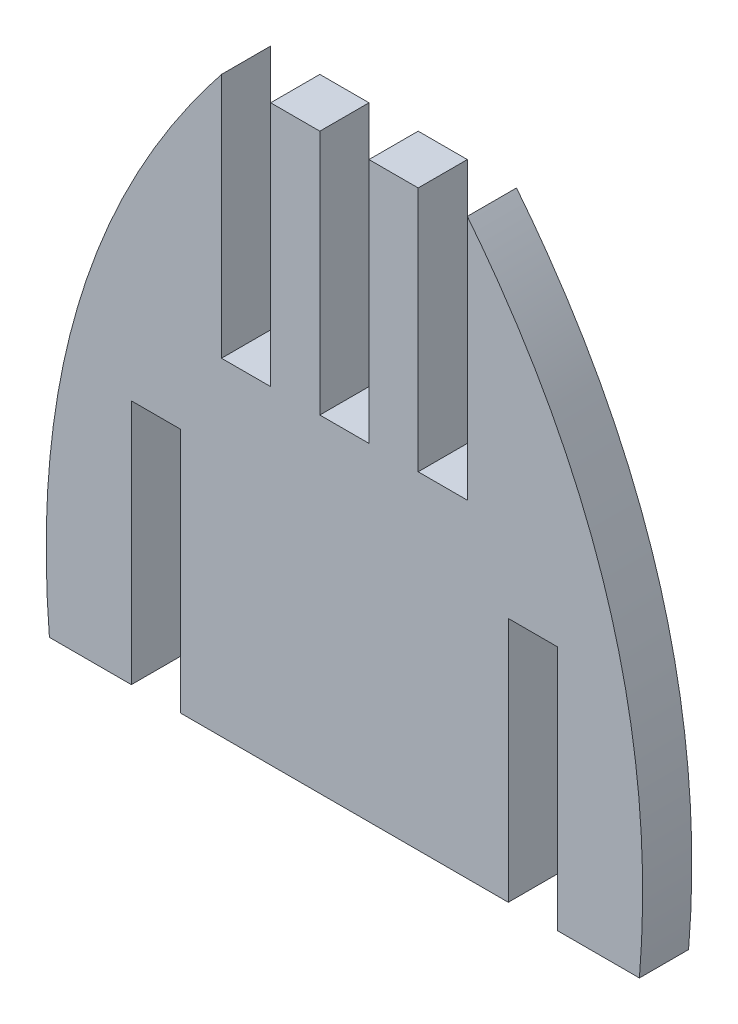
ISO-10303-21;
HEADER;
FILE_DESCRIPTION(('STEP AP214'),'2;1');
FILE_NAME('part.step','',(''),(''),'','','');
FILE_SCHEMA(('AUTOMOTIVE_DESIGN { 1 0 10303 214 1 1 1 1 }'));
ENDSEC;
DATA;
#1=APPLICATION_CONTEXT('core data for automotive mechanical design processes');
#2=APPLICATION_PROTOCOL_DEFINITION('international standard','automotive_design',2000,#1);
#3=PRODUCT_CONTEXT('',#1,'mechanical');
#4=PRODUCT('Part','Part','',(#3));
#5=PRODUCT_RELATED_PRODUCT_CATEGORY('part','',(#4));
#6=PRODUCT_DEFINITION_FORMATION('','',#4);
#7=PRODUCT_DEFINITION_CONTEXT('part definition',#1,'design');
#8=PRODUCT_DEFINITION('design','',#6,#7);
#9=PRODUCT_DEFINITION_SHAPE('','',#8);
#10=(LENGTH_UNIT() NAMED_UNIT(*) SI_UNIT(.MILLI.,.METRE.));
#11=(NAMED_UNIT(*) PLANE_ANGLE_UNIT() SI_UNIT($,.RADIAN.));
#12=(NAMED_UNIT(*) SI_UNIT($,.STERADIAN.) SOLID_ANGLE_UNIT());
#13=UNCERTAINTY_MEASURE_WITH_UNIT(LENGTH_MEASURE(1.E-05),#10,'distance_accuracy_value','');
#14=(GEOMETRIC_REPRESENTATION_CONTEXT(3) GLOBAL_UNCERTAINTY_ASSIGNED_CONTEXT((#13)) GLOBAL_UNIT_ASSIGNED_CONTEXT((#10,
#11,#12)) REPRESENTATION_CONTEXT('',''));
#15=CARTESIAN_POINT('',(0.,0.,0.));
#16=DIRECTION('',(0.,0.,1.));
#17=DIRECTION('',(1.,0.,0.));
#18=AXIS2_PLACEMENT_3D('',#15,#16,#17);
#19=CARTESIAN_POINT('',(15.1019194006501,-0.828022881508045,3.));
#20=DIRECTION('',(0.,1.,0.));
#21=DIRECTION('',(0.,0.,1.));
#22=AXIS2_PLACEMENT_3D('',#19,#20,#21);
#23=PLANE('',#22);
#24=DIRECTION('',(1.,0.,0.));
#25=VECTOR('',#24,1.);
#26=CARTESIAN_POINT('',(15.1019194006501,-0.828022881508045,0.));
#27=LINE('',#26,#25);
#28=CARTESIAN_POINT('',(15.1019194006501,-0.828022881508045,0.));
#29=VERTEX_POINT('',#28);
#30=CARTESIAN_POINT('',(20.1019194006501,-0.828022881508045,0.));
#31=VERTEX_POINT('',#30);
#32=EDGE_CURVE('E221',#29,#31,#27,.T.);
#33=ORIENTED_EDGE('',*,*,#32,.T.);
#34=DIRECTION('',(0.,0.,-1.));
#35=VECTOR('',#34,1.);
#36=CARTESIAN_POINT('',(20.1019194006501,-0.828022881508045,3.));
#37=LINE('',#36,#35);
#38=CARTESIAN_POINT('',(20.1019194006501,-0.828022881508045,3.));
#39=VERTEX_POINT('',#38);
#40=EDGE_CURVE('E11',#39,#31,#37,.T.);
#41=ORIENTED_EDGE('',*,*,#40,.F.);
#42=DIRECTION('',(1.,0.,0.));
#43=VECTOR('',#42,1.);
#44=CARTESIAN_POINT('',(15.1019194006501,-0.828022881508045,3.));
#45=LINE('',#44,#43);
#46=CARTESIAN_POINT('',(15.1019194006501,-0.828022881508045,3.));
#47=VERTEX_POINT('',#46);
#48=EDGE_CURVE('E291',#47,#39,#45,.T.);
#49=ORIENTED_EDGE('',*,*,#48,.F.);
#50=DIRECTION('',(0.,0.,-1.));
#51=VECTOR('',#50,1.);
#52=CARTESIAN_POINT('',(15.1019194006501,-0.828022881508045,3.));
#53=LINE('',#52,#51);
#54=EDGE_CURVE('E55',#47,#29,#53,.T.);
#55=ORIENTED_EDGE('',*,*,#54,.T.);
#56=EDGE_LOOP('',(#33,#41,#49,#55));
#57=FACE_BOUND('',#56,.T.);
#58=ADVANCED_FACE('F39',(#57),#23,.F.);
#59=CARTESIAN_POINT('',(20.1019194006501,-0.828022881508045,3.));
#60=CARTESIAN_POINT('',(21.7532472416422,18.8632007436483,3.));
#61=CARTESIAN_POINT('',(9.60191940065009,34.171977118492,3.));
#62=B_SPLINE_CURVE_WITH_KNOTS('',2,(#59,#60,#61),.UNSPECIFIED.,.F.,.F.,(3,3),(0.,1.),.UNSPECIFIED.);
#63=DIRECTION('',(0.,0.,-1.));
#64=VECTOR('',#63,1.);
#65=SURFACE_OF_LINEAR_EXTRUSION('',#62,#64);
#66=CARTESIAN_POINT('',(20.1019194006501,-0.828022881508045,0.));
#67=CARTESIAN_POINT('',(21.7532472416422,18.8632007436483,0.));
#68=CARTESIAN_POINT('',(9.60191940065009,34.171977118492,0.));
#69=B_SPLINE_CURVE_WITH_KNOTS('',2,(#66,#67,#68),.UNSPECIFIED.,.F.,.F.,(3,3),(0.,1.),.UNSPECIFIED.);
#70=CARTESIAN_POINT('',(9.60191940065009,34.171977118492,0.));
#71=VERTEX_POINT('',#70);
#72=EDGE_CURVE('E223',#31,#71,#69,.T.);
#73=ORIENTED_EDGE('',*,*,#72,.T.);
#74=DIRECTION('',(0.,0.,-1.));
#75=VECTOR('',#74,1.);
#76=CARTESIAN_POINT('',(9.60191940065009,34.171977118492,3.));
#77=LINE('',#76,#75);
#78=CARTESIAN_POINT('',(9.60191940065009,34.171977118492,3.));
#79=VERTEX_POINT('',#78);
#80=EDGE_CURVE('E47',#79,#71,#77,.T.);
#81=ORIENTED_EDGE('',*,*,#80,.F.);
#82=EDGE_CURVE('E136',#39,#79,#62,.T.);
#83=ORIENTED_EDGE('',*,*,#82,.F.);
#84=ORIENTED_EDGE('',*,*,#40,.T.);
#85=EDGE_LOOP('',(#73,#81,#83,#84));
#86=FACE_BOUND('',#85,.T.);
#87=ADVANCED_FACE('F333',(#86),#65,.F.);
#88=CARTESIAN_POINT('',(9.60191940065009,19.171977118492,3.));
#89=DIRECTION('',(-1.,0.,0.));
#90=DIRECTION('',(0.,0.,1.));
#91=AXIS2_PLACEMENT_3D('',#88,#89,#90);
#92=PLANE('',#91);
#93=DIRECTION('',(0.,1.,0.));
#94=VECTOR('',#93,1.);
#95=CARTESIAN_POINT('',(9.60191940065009,19.171977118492,0.));
#96=LINE('',#95,#94);
#97=CARTESIAN_POINT('',(9.60191940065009,19.171977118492,0.));
#98=VERTEX_POINT('',#97);
#99=EDGE_CURVE('E228',#98,#71,#96,.T.);
#100=ORIENTED_EDGE('',*,*,#99,.F.);
#101=DIRECTION('',(0.,0.,-1.));
#102=VECTOR('',#101,1.);
#103=CARTESIAN_POINT('',(9.60191940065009,19.171977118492,3.));
#104=LINE('',#103,#102);
#105=CARTESIAN_POINT('',(9.60191940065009,19.171977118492,3.));
#106=VERTEX_POINT('',#105);
#107=EDGE_CURVE('E326',#106,#98,#104,.T.);
#108=ORIENTED_EDGE('',*,*,#107,.F.);
#109=DIRECTION('',(0.,1.,0.));
#110=VECTOR('',#109,1.);
#111=CARTESIAN_POINT('',(9.60191940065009,19.171977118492,3.));
#112=LINE('',#111,#110);
#113=EDGE_CURVE('E332',#106,#79,#112,.T.);
#114=ORIENTED_EDGE('',*,*,#113,.T.);
#115=ORIENTED_EDGE('',*,*,#80,.T.);
#116=EDGE_LOOP('',(#100,#108,#114,#115));
#117=FACE_BOUND('',#116,.T.);
#118=ADVANCED_FACE('F330',(#117),#92,.T.);
#119=CARTESIAN_POINT('',(6.60191940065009,19.171977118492,3.));
#120=DIRECTION('',(0.,1.,0.));
#121=DIRECTION('',(0.,0.,1.));
#122=AXIS2_PLACEMENT_3D('',#119,#120,#121);
#123=PLANE('',#122);
#124=DIRECTION('',(1.,0.,0.));
#125=VECTOR('',#124,1.);
#126=CARTESIAN_POINT('',(6.60191940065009,19.171977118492,0.));
#127=LINE('',#126,#125);
#128=CARTESIAN_POINT('',(6.60191940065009,19.171977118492,0.));
#129=VERTEX_POINT('',#128);
#130=EDGE_CURVE('E234',#129,#98,#127,.T.);
#131=ORIENTED_EDGE('',*,*,#130,.F.);
#132=DIRECTION('',(0.,0.,-1.));
#133=VECTOR('',#132,1.);
#134=CARTESIAN_POINT('',(6.60191940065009,19.171977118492,3.));
#135=LINE('',#134,#133);
#136=CARTESIAN_POINT('',(6.60191940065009,19.171977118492,3.));
#137=VERTEX_POINT('',#136);
#138=EDGE_CURVE('E324',#137,#129,#135,.T.);
#139=ORIENTED_EDGE('',*,*,#138,.F.);
#140=DIRECTION('',(1.,0.,0.));
#141=VECTOR('',#140,1.);
#142=CARTESIAN_POINT('',(6.60191940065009,19.171977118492,3.));
#143=LINE('',#142,#141);
#144=EDGE_CURVE('E343',#137,#106,#143,.T.);
#145=ORIENTED_EDGE('',*,*,#144,.T.);
#146=ORIENTED_EDGE('',*,*,#107,.T.);
#147=EDGE_LOOP('',(#131,#139,#145,#146));
#148=FACE_BOUND('',#147,.T.);
#149=ADVANCED_FACE('F340',(#148),#123,.T.);
#150=CARTESIAN_POINT('',(6.60191940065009,34.171977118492,3.));
#151=DIRECTION('',(1.,0.,0.));
#152=DIRECTION('',(0.,1.,0.));
#153=AXIS2_PLACEMENT_3D('',#150,#151,#152);
#154=PLANE('',#153);
#155=DIRECTION('',(0.,-1.,0.));
#156=VECTOR('',#155,1.);
#157=CARTESIAN_POINT('',(6.60191940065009,34.171977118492,0.));
#158=LINE('',#157,#156);
#159=CARTESIAN_POINT('',(6.60191940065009,34.171977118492,0.));
#160=VERTEX_POINT('',#159);
#161=EDGE_CURVE('E237',#160,#129,#158,.T.);
#162=ORIENTED_EDGE('',*,*,#161,.F.);
#163=DIRECTION('',(0.,0.,-1.));
#164=VECTOR('',#163,1.);
#165=CARTESIAN_POINT('',(6.60191940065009,34.171977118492,3.));
#166=LINE('',#165,#164);
#167=CARTESIAN_POINT('',(6.60191940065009,34.171977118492,3.));
#168=VERTEX_POINT('',#167);
#169=EDGE_CURVE('E322',#168,#160,#166,.T.);
#170=ORIENTED_EDGE('',*,*,#169,.F.);
#171=DIRECTION('',(0.,-1.,0.));
#172=VECTOR('',#171,1.);
#173=CARTESIAN_POINT('',(6.60191940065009,34.171977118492,3.));
#174=LINE('',#173,#172);
#175=EDGE_CURVE('E347',#168,#137,#174,.T.);
#176=ORIENTED_EDGE('',*,*,#175,.T.);
#177=ORIENTED_EDGE('',*,*,#138,.T.);
#178=EDGE_LOOP('',(#162,#170,#176,#177));
#179=FACE_BOUND('',#178,.T.);
#180=ADVANCED_FACE('F429',(#179),#154,.T.);
#181=CARTESIAN_POINT('',(3.60191940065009,34.171977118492,3.));
#182=DIRECTION('',(0.,1.,0.));
#183=DIRECTION('',(0.,0.,1.));
#184=AXIS2_PLACEMENT_3D('',#181,#182,#183);
#185=PLANE('',#184);
#186=DIRECTION('',(1.,0.,0.));
#187=VECTOR('',#186,1.);
#188=CARTESIAN_POINT('',(3.60191940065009,34.171977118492,0.));
#189=LINE('',#188,#187);
#190=CARTESIAN_POINT('',(3.60191940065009,34.171977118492,0.));
#191=VERTEX_POINT('',#190);
#192=EDGE_CURVE('E240',#191,#160,#189,.T.);
#193=ORIENTED_EDGE('',*,*,#192,.F.);
#194=DIRECTION('',(0.,0.,-1.));
#195=VECTOR('',#194,1.);
#196=CARTESIAN_POINT('',(3.60191940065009,34.171977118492,3.));
#197=LINE('',#196,#195);
#198=CARTESIAN_POINT('',(3.60191940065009,34.171977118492,3.));
#199=VERTEX_POINT('',#198);
#200=EDGE_CURVE('E320',#199,#191,#197,.T.);
#201=ORIENTED_EDGE('',*,*,#200,.F.);
#202=DIRECTION('',(1.,0.,0.));
#203=VECTOR('',#202,1.);
#204=CARTESIAN_POINT('',(3.60191940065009,34.171977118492,3.));
#205=LINE('',#204,#203);
#206=EDGE_CURVE('E356',#199,#168,#205,.T.);
#207=ORIENTED_EDGE('',*,*,#206,.T.);
#208=ORIENTED_EDGE('',*,*,#169,.T.);
#209=EDGE_LOOP('',(#193,#201,#207,#208));
#210=FACE_BOUND('',#209,.T.);
#211=ADVANCED_FACE('F425',(#210),#185,.T.);
#212=CARTESIAN_POINT('',(3.60191940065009,19.171977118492,3.));
#213=DIRECTION('',(-1.,0.,0.));
#214=DIRECTION('',(0.,0.,1.));
#215=AXIS2_PLACEMENT_3D('',#212,#213,#214);
#216=PLANE('',#215);
#217=DIRECTION('',(0.,1.,0.));
#218=VECTOR('',#217,1.);
#219=CARTESIAN_POINT('',(3.60191940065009,19.171977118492,0.));
#220=LINE('',#219,#218);
#221=CARTESIAN_POINT('',(3.60191940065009,19.171977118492,0.));
#222=VERTEX_POINT('',#221);
#223=EDGE_CURVE('E243',#222,#191,#220,.T.);
#224=ORIENTED_EDGE('',*,*,#223,.F.);
#225=DIRECTION('',(0.,0.,-1.));
#226=VECTOR('',#225,1.);
#227=CARTESIAN_POINT('',(3.60191940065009,19.171977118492,3.));
#228=LINE('',#227,#226);
#229=CARTESIAN_POINT('',(3.60191940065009,19.171977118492,3.));
#230=VERTEX_POINT('',#229);
#231=EDGE_CURVE('E318',#230,#222,#228,.T.);
#232=ORIENTED_EDGE('',*,*,#231,.F.);
#233=DIRECTION('',(0.,1.,0.));
#234=VECTOR('',#233,1.);
#235=CARTESIAN_POINT('',(3.60191940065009,19.171977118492,3.));
#236=LINE('',#235,#234);
#237=EDGE_CURVE('E359',#230,#199,#236,.T.);
#238=ORIENTED_EDGE('',*,*,#237,.T.);
#239=ORIENTED_EDGE('',*,*,#200,.T.);
#240=EDGE_LOOP('',(#224,#232,#238,#239));
#241=FACE_BOUND('',#240,.T.);
#242=ADVANCED_FACE('F421',(#241),#216,.T.);
#243=CARTESIAN_POINT('',(0.601919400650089,19.171977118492,3.));
#244=DIRECTION('',(0.,1.,0.));
#245=DIRECTION('',(0.,0.,1.));
#246=AXIS2_PLACEMENT_3D('',#243,#244,#245);
#247=PLANE('',#246);
#248=DIRECTION('',(1.,0.,0.));
#249=VECTOR('',#248,1.);
#250=CARTESIAN_POINT('',(0.601919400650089,19.171977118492,0.));
#251=LINE('',#250,#249);
#252=CARTESIAN_POINT('',(0.601919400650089,19.171977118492,0.));
#253=VERTEX_POINT('',#252);
#254=EDGE_CURVE('E246',#253,#222,#251,.T.);
#255=ORIENTED_EDGE('',*,*,#254,.F.);
#256=DIRECTION('',(0.,0.,-1.));
#257=VECTOR('',#256,1.);
#258=CARTESIAN_POINT('',(0.601919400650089,19.171977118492,3.));
#259=LINE('',#258,#257);
#260=CARTESIAN_POINT('',(0.601919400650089,19.171977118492,3.));
#261=VERTEX_POINT('',#260);
#262=EDGE_CURVE('E316',#261,#253,#259,.T.);
#263=ORIENTED_EDGE('',*,*,#262,.F.);
#264=DIRECTION('',(1.,0.,0.));
#265=VECTOR('',#264,1.);
#266=CARTESIAN_POINT('',(0.601919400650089,19.171977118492,3.));
#267=LINE('',#266,#265);
#268=EDGE_CURVE('E362',#261,#230,#267,.T.);
#269=ORIENTED_EDGE('',*,*,#268,.T.);
#270=ORIENTED_EDGE('',*,*,#231,.T.);
#271=EDGE_LOOP('',(#255,#263,#269,#270));
#272=FACE_BOUND('',#271,.T.);
#273=ADVANCED_FACE('F417',(#272),#247,.T.);
#274=CARTESIAN_POINT('',(0.601919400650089,19.171977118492,3.));
#275=DIRECTION('',(-1.,0.,0.));
#276=DIRECTION('',(0.,0.,1.));
#277=AXIS2_PLACEMENT_3D('',#274,#275,#276);
#278=PLANE('',#277);
#279=DIRECTION('',(0.,1.,0.));
#280=VECTOR('',#279,1.);
#281=CARTESIAN_POINT('',(0.601919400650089,19.171977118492,0.));
#282=LINE('',#281,#280);
#283=CARTESIAN_POINT('',(0.601919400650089,34.171977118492,0.));
#284=VERTEX_POINT('',#283);
#285=EDGE_CURVE('E249',#253,#284,#282,.T.);
#286=ORIENTED_EDGE('',*,*,#285,.T.);
#287=DIRECTION('',(0.,0.,-1.));
#288=VECTOR('',#287,1.);
#289=CARTESIAN_POINT('',(0.601919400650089,34.171977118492,3.));
#290=LINE('',#289,#288);
#291=CARTESIAN_POINT('',(0.601919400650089,34.171977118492,3.));
#292=VERTEX_POINT('',#291);
#293=EDGE_CURVE('E314',#292,#284,#290,.T.);
#294=ORIENTED_EDGE('',*,*,#293,.F.);
#295=DIRECTION('',(0.,1.,0.));
#296=VECTOR('',#295,1.);
#297=CARTESIAN_POINT('',(0.601919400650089,19.171977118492,3.));
#298=LINE('',#297,#296);
#299=EDGE_CURVE('E365',#261,#292,#298,.T.);
#300=ORIENTED_EDGE('',*,*,#299,.F.);
#301=ORIENTED_EDGE('',*,*,#262,.T.);
#302=EDGE_LOOP('',(#286,#294,#300,#301));
#303=FACE_BOUND('',#302,.T.);
#304=ADVANCED_FACE('F413',(#303),#278,.F.);
#305=CARTESIAN_POINT('',(-2.39808059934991,34.171977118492,3.));
#306=DIRECTION('',(0.,1.,0.));
#307=DIRECTION('',(0.,0.,1.));
#308=AXIS2_PLACEMENT_3D('',#305,#306,#307);
#309=PLANE('',#308);
#310=DIRECTION('',(1.,0.,0.));
#311=VECTOR('',#310,1.);
#312=CARTESIAN_POINT('',(-2.39808059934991,34.171977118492,0.));
#313=LINE('',#312,#311);
#314=CARTESIAN_POINT('',(-2.39808059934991,34.171977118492,0.));
#315=VERTEX_POINT('',#314);
#316=EDGE_CURVE('E252',#315,#284,#313,.T.);
#317=ORIENTED_EDGE('',*,*,#316,.F.);
#318=DIRECTION('',(0.,0.,-1.));
#319=VECTOR('',#318,1.);
#320=CARTESIAN_POINT('',(-2.39808059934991,34.171977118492,3.));
#321=LINE('',#320,#319);
#322=CARTESIAN_POINT('',(-2.39808059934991,34.171977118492,3.));
#323=VERTEX_POINT('',#322);
#324=EDGE_CURVE('E312',#323,#315,#321,.T.);
#325=ORIENTED_EDGE('',*,*,#324,.F.);
#326=DIRECTION('',(1.,0.,0.));
#327=VECTOR('',#326,1.);
#328=CARTESIAN_POINT('',(-2.39808059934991,34.171977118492,3.));
#329=LINE('',#328,#327);
#330=EDGE_CURVE('E367',#323,#292,#329,.T.);
#331=ORIENTED_EDGE('',*,*,#330,.T.);
#332=ORIENTED_EDGE('',*,*,#293,.T.);
#333=EDGE_LOOP('',(#317,#325,#331,#332));
#334=FACE_BOUND('',#333,.T.);
#335=ADVANCED_FACE('F409',(#334),#309,.T.);
#336=CARTESIAN_POINT('',(-2.39808059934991,19.171977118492,3.));
#337=DIRECTION('',(-1.,0.,0.));
#338=DIRECTION('',(0.,0.,1.));
#339=AXIS2_PLACEMENT_3D('',#336,#337,#338);
#340=PLANE('',#339);
#341=DIRECTION('',(0.,1.,0.));
#342=VECTOR('',#341,1.);
#343=CARTESIAN_POINT('',(-2.39808059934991,19.171977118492,0.));
#344=LINE('',#343,#342);
#345=CARTESIAN_POINT('',(-2.39808059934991,19.171977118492,0.));
#346=VERTEX_POINT('',#345);
#347=EDGE_CURVE('E255',#346,#315,#344,.T.);
#348=ORIENTED_EDGE('',*,*,#347,.F.);
#349=DIRECTION('',(0.,0.,-1.));
#350=VECTOR('',#349,1.);
#351=CARTESIAN_POINT('',(-2.39808059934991,19.171977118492,3.));
#352=LINE('',#351,#350);
#353=CARTESIAN_POINT('',(-2.39808059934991,19.171977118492,3.));
#354=VERTEX_POINT('',#353);
#355=EDGE_CURVE('E310',#354,#346,#352,.T.);
#356=ORIENTED_EDGE('',*,*,#355,.F.);
#357=DIRECTION('',(0.,1.,0.));
#358=VECTOR('',#357,1.);
#359=CARTESIAN_POINT('',(-2.39808059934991,19.171977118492,3.));
#360=LINE('',#359,#358);
#361=EDGE_CURVE('E370',#354,#323,#360,.T.);
#362=ORIENTED_EDGE('',*,*,#361,.T.);
#363=ORIENTED_EDGE('',*,*,#324,.T.);
#364=EDGE_LOOP('',(#348,#356,#362,#363));
#365=FACE_BOUND('',#364,.T.);
#366=ADVANCED_FACE('F405',(#365),#340,.T.);
#367=CARTESIAN_POINT('',(-5.39808059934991,19.171977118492,3.));
#368=DIRECTION('',(0.,1.,0.));
#369=DIRECTION('',(0.,0.,1.));
#370=AXIS2_PLACEMENT_3D('',#367,#368,#369);
#371=PLANE('',#370);
#372=DIRECTION('',(1.,0.,0.));
#373=VECTOR('',#372,1.);
#374=CARTESIAN_POINT('',(-5.39808059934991,19.171977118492,0.));
#375=LINE('',#374,#373);
#376=CARTESIAN_POINT('',(-5.39808059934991,19.171977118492,0.));
#377=VERTEX_POINT('',#376);
#378=EDGE_CURVE('E258',#377,#346,#375,.T.);
#379=ORIENTED_EDGE('',*,*,#378,.F.);
#380=DIRECTION('',(0.,0.,-1.));
#381=VECTOR('',#380,1.);
#382=CARTESIAN_POINT('',(-5.39808059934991,19.171977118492,3.));
#383=LINE('',#382,#381);
#384=CARTESIAN_POINT('',(-5.39808059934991,19.171977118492,3.));
#385=VERTEX_POINT('',#384);
#386=EDGE_CURVE('E308',#385,#377,#383,.T.);
#387=ORIENTED_EDGE('',*,*,#386,.F.);
#388=DIRECTION('',(1.,0.,0.));
#389=VECTOR('',#388,1.);
#390=CARTESIAN_POINT('',(-5.39808059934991,19.171977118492,3.));
#391=LINE('',#390,#389);
#392=EDGE_CURVE('E373',#385,#354,#391,.T.);
#393=ORIENTED_EDGE('',*,*,#392,.T.);
#394=ORIENTED_EDGE('',*,*,#355,.T.);
#395=EDGE_LOOP('',(#379,#387,#393,#394));
#396=FACE_BOUND('',#395,.T.);
#397=ADVANCED_FACE('F401',(#396),#371,.T.);
#398=CARTESIAN_POINT('',(-5.39808059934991,34.171977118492,3.));
#399=DIRECTION('',(1.,0.,0.));
#400=DIRECTION('',(0.,1.,0.));
#401=AXIS2_PLACEMENT_3D('',#398,#399,#400);
#402=PLANE('',#401);
#403=DIRECTION('',(0.,-1.,0.));
#404=VECTOR('',#403,1.);
#405=CARTESIAN_POINT('',(-5.39808059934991,34.171977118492,0.));
#406=LINE('',#405,#404);
#407=CARTESIAN_POINT('',(-5.39808059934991,34.171977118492,0.));
#408=VERTEX_POINT('',#407);
#409=EDGE_CURVE('E261',#408,#377,#406,.T.);
#410=ORIENTED_EDGE('',*,*,#409,.F.);
#411=DIRECTION('',(0.,0.,-1.));
#412=VECTOR('',#411,1.);
#413=CARTESIAN_POINT('',(-5.39808059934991,34.171977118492,3.));
#414=LINE('',#413,#412);
#415=CARTESIAN_POINT('',(-5.39808059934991,34.171977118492,3.));
#416=VERTEX_POINT('',#415);
#417=EDGE_CURVE('E306',#416,#408,#414,.T.);
#418=ORIENTED_EDGE('',*,*,#417,.F.);
#419=DIRECTION('',(0.,-1.,0.));
#420=VECTOR('',#419,1.);
#421=CARTESIAN_POINT('',(-5.39808059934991,34.171977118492,3.));
#422=LINE('',#421,#420);
#423=EDGE_CURVE('E376',#416,#385,#422,.T.);
#424=ORIENTED_EDGE('',*,*,#423,.T.);
#425=ORIENTED_EDGE('',*,*,#386,.T.);
#426=EDGE_LOOP('',(#410,#418,#424,#425));
#427=FACE_BOUND('',#426,.T.);
#428=ADVANCED_FACE('F396',(#427),#402,.T.);
#429=CARTESIAN_POINT('',(-15.8980805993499,-0.828022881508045,3.));
#430=CARTESIAN_POINT('',(-17.549408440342,18.8632007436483,3.));
#431=CARTESIAN_POINT('',(-5.39808059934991,34.171977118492,3.));
#432=B_SPLINE_CURVE_WITH_KNOTS('',2,(#429,#430,#431),.UNSPECIFIED.,.F.,.F.,(3,3),(0.,1.),.UNSPECIFIED.);
#433=DIRECTION('',(0.,0.,-1.));
#434=VECTOR('',#433,1.);
#435=SURFACE_OF_LINEAR_EXTRUSION('',#432,#434);
#436=CARTESIAN_POINT('',(-15.8980805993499,-0.828022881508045,0.));
#437=CARTESIAN_POINT('',(-17.549408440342,18.8632007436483,0.));
#438=CARTESIAN_POINT('',(-5.39808059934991,34.171977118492,0.));
#439=B_SPLINE_CURVE_WITH_KNOTS('',2,(#436,#437,#438),.UNSPECIFIED.,.F.,.F.,(3,3),(0.,1.),.UNSPECIFIED.);
#440=CARTESIAN_POINT('',(-15.8980805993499,-0.828022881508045,0.));
#441=VERTEX_POINT('',#440);
#442=EDGE_CURVE('E264',#441,#408,#439,.T.);
#443=ORIENTED_EDGE('',*,*,#442,.F.);
#444=DIRECTION('',(0.,0.,-1.));
#445=VECTOR('',#444,1.);
#446=CARTESIAN_POINT('',(-15.8980805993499,-0.828022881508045,3.));
#447=LINE('',#446,#445);
#448=CARTESIAN_POINT('',(-15.8980805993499,-0.828022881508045,3.));
#449=VERTEX_POINT('',#448);
#450=EDGE_CURVE('E304',#449,#441,#447,.T.);
#451=ORIENTED_EDGE('',*,*,#450,.F.);
#452=EDGE_CURVE('E379',#449,#416,#432,.T.);
#453=ORIENTED_EDGE('',*,*,#452,.T.);
#454=ORIENTED_EDGE('',*,*,#417,.T.);
#455=EDGE_LOOP('',(#443,#451,#453,#454));
#456=FACE_BOUND('',#455,.T.);
#457=ADVANCED_FACE('F391',(#456),#435,.T.);
#458=CARTESIAN_POINT('',(-15.8980805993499,-0.828022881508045,3.));
#459=DIRECTION('',(0.,1.,0.));
#460=DIRECTION('',(0.,0.,1.));
#461=AXIS2_PLACEMENT_3D('',#458,#459,#460);
#462=PLANE('',#461);
#463=DIRECTION('',(1.,0.,0.));
#464=VECTOR('',#463,1.);
#465=CARTESIAN_POINT('',(-15.8980805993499,-0.828022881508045,0.));
#466=LINE('',#465,#464);
#467=CARTESIAN_POINT('',(-10.8980805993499,-0.828022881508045,0.));
#468=VERTEX_POINT('',#467);
#469=EDGE_CURVE('E269',#441,#468,#466,.T.);
#470=ORIENTED_EDGE('',*,*,#469,.T.);
#471=DIRECTION('',(0.,0.,-1.));
#472=VECTOR('',#471,1.);
#473=CARTESIAN_POINT('',(-10.8980805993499,-0.828022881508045,3.));
#474=LINE('',#473,#472);
#475=CARTESIAN_POINT('',(-10.8980805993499,-0.828022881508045,3.));
#476=VERTEX_POINT('',#475);
#477=EDGE_CURVE('E301',#476,#468,#474,.T.);
#478=ORIENTED_EDGE('',*,*,#477,.F.);
#479=DIRECTION('',(1.,0.,0.));
#480=VECTOR('',#479,1.);
#481=CARTESIAN_POINT('',(-15.8980805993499,-0.828022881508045,3.));
#482=LINE('',#481,#480);
#483=EDGE_CURVE('E385',#449,#476,#482,.T.);
#484=ORIENTED_EDGE('',*,*,#483,.F.);
#485=ORIENTED_EDGE('',*,*,#450,.T.);
#486=EDGE_LOOP('',(#470,#478,#484,#485));
#487=FACE_BOUND('',#486,.T.);
#488=ADVANCED_FACE('F395',(#487),#462,.F.);
#489=CARTESIAN_POINT('',(-10.8980805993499,-0.828022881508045,3.));
#490=DIRECTION('',(-1.,0.,0.));
#491=DIRECTION('',(0.,-1.,0.));
#492=AXIS2_PLACEMENT_3D('',#489,#490,#491);
#493=PLANE('',#492);
#494=DIRECTION('',(0.,1.,0.));
#495=VECTOR('',#494,1.);
#496=CARTESIAN_POINT('',(-10.8980805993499,-0.828022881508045,0.));
#497=LINE('',#496,#495);
#498=CARTESIAN_POINT('',(-10.8980805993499,14.171977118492,0.));
#499=VERTEX_POINT('',#498);
#500=EDGE_CURVE('E274',#468,#499,#497,.T.);
#501=ORIENTED_EDGE('',*,*,#500,.T.);
#502=DIRECTION('',(0.,0.,-1.));
#503=VECTOR('',#502,1.);
#504=CARTESIAN_POINT('',(-10.8980805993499,14.171977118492,3.));
#505=LINE('',#504,#503);
#506=CARTESIAN_POINT('',(-10.8980805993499,14.171977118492,3.));
#507=VERTEX_POINT('',#506);
#508=EDGE_CURVE('E299',#507,#499,#505,.T.);
#509=ORIENTED_EDGE('',*,*,#508,.F.);
#510=DIRECTION('',(0.,1.,0.));
#511=VECTOR('',#510,1.);
#512=CARTESIAN_POINT('',(-10.8980805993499,-0.828022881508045,3.));
#513=LINE('',#512,#511);
#514=EDGE_CURVE('E487',#476,#507,#513,.T.);
#515=ORIENTED_EDGE('',*,*,#514,.F.);
#516=ORIENTED_EDGE('',*,*,#477,.T.);
#517=EDGE_LOOP('',(#501,#509,#515,#516));
#518=FACE_BOUND('',#517,.T.);
#519=ADVANCED_FACE('F466',(#518),#493,.F.);
#520=CARTESIAN_POINT('',(-7.89808059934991,14.171977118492,3.));
#521=DIRECTION('',(0.,-1.,0.));
#522=DIRECTION('',(0.,0.,-1.));
#523=AXIS2_PLACEMENT_3D('',#520,#521,#522);
#524=PLANE('',#523);
#525=DIRECTION('',(-1.,0.,0.));
#526=VECTOR('',#525,1.);
#527=CARTESIAN_POINT('',(-7.89808059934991,14.171977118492,0.));
#528=LINE('',#527,#526);
#529=CARTESIAN_POINT('',(-7.89808059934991,14.171977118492,0.));
#530=VERTEX_POINT('',#529);
#531=EDGE_CURVE('E277',#530,#499,#528,.T.);
#532=ORIENTED_EDGE('',*,*,#531,.F.);
#533=DIRECTION('',(0.,0.,-1.));
#534=VECTOR('',#533,1.);
#535=CARTESIAN_POINT('',(-7.89808059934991,14.171977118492,3.));
#536=LINE('',#535,#534);
#537=CARTESIAN_POINT('',(-7.89808059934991,14.171977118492,3.));
#538=VERTEX_POINT('',#537);
#539=EDGE_CURVE('E297',#538,#530,#536,.T.);
#540=ORIENTED_EDGE('',*,*,#539,.F.);
#541=DIRECTION('',(-1.,0.,0.));
#542=VECTOR('',#541,1.);
#543=CARTESIAN_POINT('',(-7.89808059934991,14.171977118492,3.));
#544=LINE('',#543,#542);
#545=EDGE_CURVE('E484',#538,#507,#544,.T.);
#546=ORIENTED_EDGE('',*,*,#545,.T.);
#547=ORIENTED_EDGE('',*,*,#508,.T.);
#548=EDGE_LOOP('',(#532,#540,#546,#547));
#549=FACE_BOUND('',#548,.T.);
#550=ADVANCED_FACE('F463',(#549),#524,.T.);
#551=CARTESIAN_POINT('',(-7.89808059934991,-0.828022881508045,3.));
#552=DIRECTION('',(-1.,0.,0.));
#553=DIRECTION('',(0.,-1.,0.));
#554=AXIS2_PLACEMENT_3D('',#551,#552,#553);
#555=PLANE('',#554);
#556=DIRECTION('',(0.,1.,0.));
#557=VECTOR('',#556,1.);
#558=CARTESIAN_POINT('',(-7.89808059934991,-0.828022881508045,0.));
#559=LINE('',#558,#557);
#560=CARTESIAN_POINT('',(-7.89808059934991,-0.828022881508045,0.));
#561=VERTEX_POINT('',#560);
#562=EDGE_CURVE('E280',#561,#530,#559,.T.);
#563=ORIENTED_EDGE('',*,*,#562,.F.);
#564=DIRECTION('',(0.,0.,-1.));
#565=VECTOR('',#564,1.);
#566=CARTESIAN_POINT('',(-7.89808059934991,-0.828022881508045,3.));
#567=LINE('',#566,#565);
#568=CARTESIAN_POINT('',(-7.89808059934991,-0.828022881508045,3.));
#569=VERTEX_POINT('',#568);
#570=EDGE_CURVE('E295',#569,#561,#567,.T.);
#571=ORIENTED_EDGE('',*,*,#570,.F.);
#572=DIRECTION('',(0.,1.,0.));
#573=VECTOR('',#572,1.);
#574=CARTESIAN_POINT('',(-7.89808059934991,-0.828022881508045,3.));
#575=LINE('',#574,#573);
#576=EDGE_CURVE('E486',#569,#538,#575,.T.);
#577=ORIENTED_EDGE('',*,*,#576,.T.);
#578=ORIENTED_EDGE('',*,*,#539,.T.);
#579=EDGE_LOOP('',(#563,#571,#577,#578));
#580=FACE_BOUND('',#579,.T.);
#581=ADVANCED_FACE('F459',(#580),#555,.T.);
#582=CARTESIAN_POINT('',(-7.89808059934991,-0.828022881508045,3.));
#583=DIRECTION('',(0.,1.,0.));
#584=DIRECTION('',(0.,0.,1.));
#585=AXIS2_PLACEMENT_3D('',#582,#583,#584);
#586=PLANE('',#585);
#587=DIRECTION('',(1.,0.,0.));
#588=VECTOR('',#587,1.);
#589=CARTESIAN_POINT('',(-7.89808059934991,-0.828022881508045,0.));
#590=LINE('',#589,#588);
#591=CARTESIAN_POINT('',(12.1019194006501,-0.828022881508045,0.));
#592=VERTEX_POINT('',#591);
#593=EDGE_CURVE('E283',#561,#592,#590,.T.);
#594=ORIENTED_EDGE('',*,*,#593,.T.);
#595=DIRECTION('',(0.,0.,-1.));
#596=VECTOR('',#595,1.);
#597=CARTESIAN_POINT('',(12.1019194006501,-0.828022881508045,3.));
#598=LINE('',#597,#596);
#599=CARTESIAN_POINT('',(12.1019194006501,-0.828022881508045,3.));
#600=VERTEX_POINT('',#599);
#601=EDGE_CURVE('E213',#600,#592,#598,.T.);
#602=ORIENTED_EDGE('',*,*,#601,.F.);
#603=DIRECTION('',(1.,0.,0.));
#604=VECTOR('',#603,1.);
#605=CARTESIAN_POINT('',(-7.89808059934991,-0.828022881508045,3.));
#606=LINE('',#605,#604);
#607=EDGE_CURVE('E201',#569,#600,#606,.T.);
#608=ORIENTED_EDGE('',*,*,#607,.F.);
#609=ORIENTED_EDGE('',*,*,#570,.T.);
#610=EDGE_LOOP('',(#594,#602,#608,#609));
#611=FACE_BOUND('',#610,.T.);
#612=ADVANCED_FACE('F456',(#611),#586,.F.);
#613=CARTESIAN_POINT('',(12.1019194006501,-0.828022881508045,3.));
#614=DIRECTION('',(-1.,0.,0.));
#615=DIRECTION('',(0.,-1.,0.));
#616=AXIS2_PLACEMENT_3D('',#613,#614,#615);
#617=PLANE('',#616);
#618=DIRECTION('',(0.,1.,0.));
#619=VECTOR('',#618,1.);
#620=CARTESIAN_POINT('',(12.1019194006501,-0.828022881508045,0.));
#621=LINE('',#620,#619);
#622=CARTESIAN_POINT('',(12.1019194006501,14.171977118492,0.));
#623=VERTEX_POINT('',#622);
#624=EDGE_CURVE('E210',#592,#623,#621,.T.);
#625=ORIENTED_EDGE('',*,*,#624,.T.);
#626=DIRECTION('',(0.,0.,-1.));
#627=VECTOR('',#626,1.);
#628=CARTESIAN_POINT('',(12.1019194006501,14.171977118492,3.));
#629=LINE('',#628,#627);
#630=CARTESIAN_POINT('',(12.1019194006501,14.171977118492,3.));
#631=VERTEX_POINT('',#630);
#632=EDGE_CURVE('E207',#631,#623,#629,.T.);
#633=ORIENTED_EDGE('',*,*,#632,.F.);
#634=DIRECTION('',(0.,1.,0.));
#635=VECTOR('',#634,1.);
#636=CARTESIAN_POINT('',(12.1019194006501,-0.828022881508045,3.));
#637=LINE('',#636,#635);
#638=EDGE_CURVE('E193',#600,#631,#637,.T.);
#639=ORIENTED_EDGE('',*,*,#638,.F.);
#640=ORIENTED_EDGE('',*,*,#601,.T.);
#641=EDGE_LOOP('',(#625,#633,#639,#640));
#642=FACE_BOUND('',#641,.T.);
#643=ADVANCED_FACE('F208',(#642),#617,.F.);
#644=CARTESIAN_POINT('',(12.1019194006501,14.171977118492,3.));
#645=DIRECTION('',(0.,1.,0.));
#646=DIRECTION('',(0.,0.,1.));
#647=AXIS2_PLACEMENT_3D('',#644,#645,#646);
#648=PLANE('',#647);
#649=DIRECTION('',(1.,0.,0.));
#650=VECTOR('',#649,1.);
#651=CARTESIAN_POINT('',(12.1019194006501,14.171977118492,0.));
#652=LINE('',#651,#650);
#653=CARTESIAN_POINT('',(15.1019194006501,14.171977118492,0.));
#654=VERTEX_POINT('',#653);
#655=EDGE_CURVE('E286',#623,#654,#652,.T.);
#656=ORIENTED_EDGE('',*,*,#655,.T.);
#657=DIRECTION('',(0.,0.,-1.));
#658=VECTOR('',#657,1.);
#659=CARTESIAN_POINT('',(15.1019194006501,14.171977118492,3.));
#660=LINE('',#659,#658);
#661=CARTESIAN_POINT('',(15.1019194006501,14.171977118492,3.));
#662=VERTEX_POINT('',#661);
#663=EDGE_CURVE('E124',#662,#654,#660,.T.);
#664=ORIENTED_EDGE('',*,*,#663,.F.);
#665=DIRECTION('',(1.,0.,0.));
#666=VECTOR('',#665,1.);
#667=CARTESIAN_POINT('',(12.1019194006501,14.171977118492,3.));
#668=LINE('',#667,#666);
#669=EDGE_CURVE('E198',#631,#662,#668,.T.);
#670=ORIENTED_EDGE('',*,*,#669,.F.);
#671=ORIENTED_EDGE('',*,*,#632,.T.);
#672=EDGE_LOOP('',(#656,#664,#670,#671));
#673=FACE_BOUND('',#672,.T.);
#674=ADVANCED_FACE('F215',(#673),#648,.F.);
#675=CARTESIAN_POINT('',(15.1019194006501,-0.828022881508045,3.));
#676=DIRECTION('',(-1.,0.,0.));
#677=DIRECTION('',(0.,-1.,0.));
#678=AXIS2_PLACEMENT_3D('',#675,#676,#677);
#679=PLANE('',#678);
#680=DIRECTION('',(0.,1.,0.));
#681=VECTOR('',#680,1.);
#682=CARTESIAN_POINT('',(15.1019194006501,-0.828022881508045,0.));
#683=LINE('',#682,#681);
#684=EDGE_CURVE('E288',#29,#654,#683,.T.);
#685=ORIENTED_EDGE('',*,*,#684,.F.);
#686=ORIENTED_EDGE('',*,*,#54,.F.);
#687=DIRECTION('',(0.,1.,0.));
#688=VECTOR('',#687,1.);
#689=CARTESIAN_POINT('',(15.1019194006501,-0.828022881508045,3.));
#690=LINE('',#689,#688);
#691=EDGE_CURVE('E216',#47,#662,#690,.T.);
#692=ORIENTED_EDGE('',*,*,#691,.T.);
#693=ORIENTED_EDGE('',*,*,#663,.T.);
#694=EDGE_LOOP('',(#685,#686,#692,#693));
#695=FACE_BOUND('',#694,.T.);
#696=ADVANCED_FACE('F443',(#695),#679,.T.);
#697=CARTESIAN_POINT('',(18.3025833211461,17.7675889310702,3.));
#698=DIRECTION('',(0.,0.,-1.));
#699=DIRECTION('',(-1.,0.,0.));
#700=AXIS2_PLACEMENT_3D('',#697,#698,#699);
#701=PLANE('',#700);
#702=ORIENTED_EDGE('',*,*,#48,.T.);
#703=ORIENTED_EDGE('',*,*,#82,.T.);
#704=ORIENTED_EDGE('',*,*,#113,.F.);
#705=ORIENTED_EDGE('',*,*,#144,.F.);
#706=ORIENTED_EDGE('',*,*,#175,.F.);
#707=ORIENTED_EDGE('',*,*,#206,.F.);
#708=ORIENTED_EDGE('',*,*,#237,.F.);
#709=ORIENTED_EDGE('',*,*,#268,.F.);
#710=ORIENTED_EDGE('',*,*,#299,.T.);
#711=ORIENTED_EDGE('',*,*,#330,.F.);
#712=ORIENTED_EDGE('',*,*,#361,.F.);
#713=ORIENTED_EDGE('',*,*,#392,.F.);
#714=ORIENTED_EDGE('',*,*,#423,.F.);
#715=ORIENTED_EDGE('',*,*,#452,.F.);
#716=ORIENTED_EDGE('',*,*,#483,.T.);
#717=ORIENTED_EDGE('',*,*,#514,.T.);
#718=ORIENTED_EDGE('',*,*,#545,.F.);
#719=ORIENTED_EDGE('',*,*,#576,.F.);
#720=ORIENTED_EDGE('',*,*,#607,.T.);
#721=ORIENTED_EDGE('',*,*,#638,.T.);
#722=ORIENTED_EDGE('',*,*,#669,.T.);
#723=ORIENTED_EDGE('',*,*,#691,.F.);
#724=EDGE_LOOP('',(#702,#703,#704,#705,#706,#707,#708,#709,#710,#711,#712,#713,#714,#715,#716,
#717,#718,#719,#720,#721,#722,#723));
#725=FACE_BOUND('',#724,.T.);
#726=ADVANCED_FACE('F195',(#725),#701,.F.);
#727=CARTESIAN_POINT('',(18.3025833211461,17.7675889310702,0.));
#728=DIRECTION('',(0.,0.,-1.));
#729=DIRECTION('',(-1.,0.,0.));
#730=AXIS2_PLACEMENT_3D('',#727,#728,#729);
#731=PLANE('',#730);
#732=ORIENTED_EDGE('',*,*,#32,.F.);
#733=ORIENTED_EDGE('',*,*,#684,.T.);
#734=ORIENTED_EDGE('',*,*,#655,.F.);
#735=ORIENTED_EDGE('',*,*,#624,.F.);
#736=ORIENTED_EDGE('',*,*,#593,.F.);
#737=ORIENTED_EDGE('',*,*,#562,.T.);
#738=ORIENTED_EDGE('',*,*,#531,.T.);
#739=ORIENTED_EDGE('',*,*,#500,.F.);
#740=ORIENTED_EDGE('',*,*,#469,.F.);
#741=ORIENTED_EDGE('',*,*,#442,.T.);
#742=ORIENTED_EDGE('',*,*,#409,.T.);
#743=ORIENTED_EDGE('',*,*,#378,.T.);
#744=ORIENTED_EDGE('',*,*,#347,.T.);
#745=ORIENTED_EDGE('',*,*,#316,.T.);
#746=ORIENTED_EDGE('',*,*,#285,.F.);
#747=ORIENTED_EDGE('',*,*,#254,.T.);
#748=ORIENTED_EDGE('',*,*,#223,.T.);
#749=ORIENTED_EDGE('',*,*,#192,.T.);
#750=ORIENTED_EDGE('',*,*,#161,.T.);
#751=ORIENTED_EDGE('',*,*,#130,.T.);
#752=ORIENTED_EDGE('',*,*,#99,.T.);
#753=ORIENTED_EDGE('',*,*,#72,.F.);
#754=EDGE_LOOP('',(#732,#733,#734,#735,#736,#737,#738,#739,#740,#741,#742,#743,#744,#745,#746,
#747,#748,#749,#750,#751,#752,#753));
#755=FACE_BOUND('',#754,.T.);
#756=ADVANCED_FACE('F336',(#755),#731,.T.);
#757=CLOSED_SHELL('',(#58,#87,#118,#149,#180,#211,#242,#273,#304,#335,#366,#397,#428,#457,#488,
#519,#550,#581,#612,#643,#674,#696,#726,#756));
#758=MANIFOLD_SOLID_BREP('B2',#757);
#759=ADVANCED_BREP_SHAPE_REPRESENTATION('',(#18,#758),#14);
#760=SHAPE_DEFINITION_REPRESENTATION(#9,#759);
ENDSEC;
END-ISO-10303-21;
